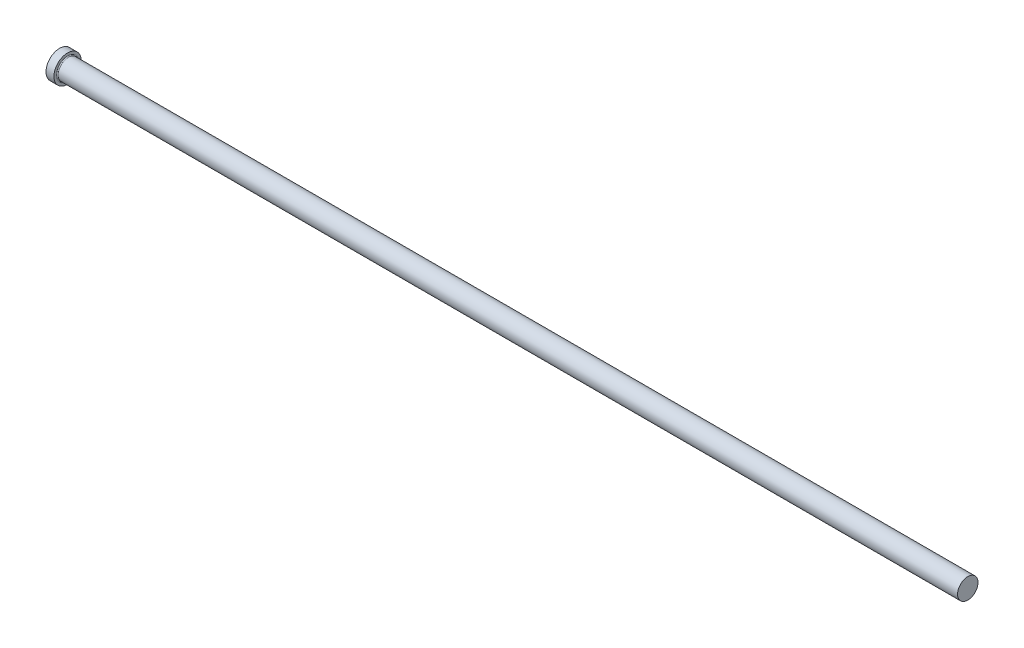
ISO-10303-21;
HEADER;
FILE_DESCRIPTION(('STEP AP214'),'2;1');
FILE_NAME('part.step','',(''),(''),'','','');
FILE_SCHEMA(('AUTOMOTIVE_DESIGN { 1 0 10303 214 1 1 1 1 }'));
ENDSEC;
DATA;
#1=APPLICATION_CONTEXT('core data for automotive mechanical design processes');
#2=APPLICATION_PROTOCOL_DEFINITION('international standard','automotive_design',2000,#1);
#3=PRODUCT_CONTEXT('',#1,'mechanical');
#4=PRODUCT('Part','Part','',(#3));
#5=PRODUCT_RELATED_PRODUCT_CATEGORY('part','',(#4));
#6=PRODUCT_DEFINITION_FORMATION('','',#4);
#7=PRODUCT_DEFINITION_CONTEXT('part definition',#1,'design');
#8=PRODUCT_DEFINITION('design','',#6,#7);
#9=PRODUCT_DEFINITION_SHAPE('','',#8);
#10=(LENGTH_UNIT() NAMED_UNIT(*) SI_UNIT(.MILLI.,.METRE.));
#11=(NAMED_UNIT(*) PLANE_ANGLE_UNIT() SI_UNIT($,.RADIAN.));
#12=(NAMED_UNIT(*) SI_UNIT($,.STERADIAN.) SOLID_ANGLE_UNIT());
#13=UNCERTAINTY_MEASURE_WITH_UNIT(LENGTH_MEASURE(1.E-05),#10,'distance_accuracy_value','');
#14=(GEOMETRIC_REPRESENTATION_CONTEXT(3) GLOBAL_UNCERTAINTY_ASSIGNED_CONTEXT((#13)) GLOBAL_UNIT_ASSIGNED_CONTEXT((#10,
#11,#12)) REPRESENTATION_CONTEXT('',''));
#15=CARTESIAN_POINT('',(0.,0.,0.));
#16=DIRECTION('',(0.,0.,1.));
#17=DIRECTION('',(1.,0.,0.));
#18=AXIS2_PLACEMENT_3D('',#15,#16,#17);
#19=CARTESIAN_POINT('',(0.,0.,0.));
#20=DIRECTION('',(-1.,0.,0.));
#21=DIRECTION('',(0.,-1.,0.));
#22=AXIS2_PLACEMENT_3D('',#19,#20,#21);
#23=PLANE('',#22);
#24=CARTESIAN_POINT('',(0.,0.,0.));
#25=DIRECTION('',(1.,0.,0.));
#26=DIRECTION('',(0.,1.,0.));
#27=AXIS2_PLACEMENT_3D('',#24,#25,#26);
#28=CIRCLE('',#27,12.);
#29=CARTESIAN_POINT('',(0.,12.,0.));
#30=VERTEX_POINT('',#29);
#31=EDGE_CURVE('E25',#30,#30,#28,.T.);
#32=ORIENTED_EDGE('',*,*,#31,.F.);
#33=EDGE_LOOP('',(#32));
#34=FACE_BOUND('',#33,.T.);
#35=ADVANCED_FACE('F14',(#34),#23,.T.);
#36=CARTESIAN_POINT('',(800.,0.,0.));
#37=DIRECTION('',(1.,0.,0.));
#38=DIRECTION('',(0.,1.,0.));
#39=AXIS2_PLACEMENT_3D('',#36,#37,#38);
#40=CYLINDRICAL_SURFACE('',#39,12.);
#41=ORIENTED_EDGE('',*,*,#31,.T.);
#42=EDGE_LOOP('',(#41));
#43=FACE_BOUND('',#42,.T.);
#44=CARTESIAN_POINT('',(7.,0.,0.));
#45=DIRECTION('',(1.,0.,0.));
#46=DIRECTION('',(0.,1.,0.));
#47=AXIS2_PLACEMENT_3D('',#44,#45,#46);
#48=CIRCLE('',#47,12.);
#49=CARTESIAN_POINT('',(7.,12.,0.));
#50=VERTEX_POINT('',#49);
#51=EDGE_CURVE('E29',#50,#50,#48,.T.);
#52=ORIENTED_EDGE('',*,*,#51,.F.);
#53=EDGE_LOOP('',(#52));
#54=FACE_BOUND('',#53,.T.);
#55=ADVANCED_FACE('F51',(#43,#54),#40,.T.);
#56=CARTESIAN_POINT('',(7.,12.,0.));
#57=DIRECTION('',(1.,0.,0.));
#58=DIRECTION('',(0.,1.,0.));
#59=AXIS2_PLACEMENT_3D('',#56,#57,#58);
#60=PLANE('',#59);
#61=CARTESIAN_POINT('',(7.,0.,0.));
#62=DIRECTION('',(1.,0.,0.));
#63=DIRECTION('',(0.,1.,0.));
#64=AXIS2_PLACEMENT_3D('',#61,#62,#63);
#65=CIRCLE('',#64,9.8);
#66=CARTESIAN_POINT('',(7.,9.8,0.));
#67=VERTEX_POINT('',#66);
#68=EDGE_CURVE('E9',#67,#67,#65,.F.);
#69=ORIENTED_EDGE('',*,*,#68,.T.);
#70=EDGE_LOOP('',(#69));
#71=FACE_BOUND('',#70,.T.);
#72=ORIENTED_EDGE('',*,*,#51,.T.);
#73=EDGE_LOOP('',(#72));
#74=FACE_BOUND('',#73,.T.);
#75=ADVANCED_FACE('F42',(#71,#74),#60,.T.);
#76=CARTESIAN_POINT('',(800.,0.,0.));
#77=DIRECTION('',(1.,0.,0.));
#78=DIRECTION('',(0.,1.,0.));
#79=AXIS2_PLACEMENT_3D('',#76,#77,#78);
#80=CYLINDRICAL_SURFACE('',#79,9.);
#81=CARTESIAN_POINT('',(7.8,0.,0.));
#82=DIRECTION('',(1.,0.,0.));
#83=DIRECTION('',(0.,1.,0.));
#84=AXIS2_PLACEMENT_3D('',#81,#82,#83);
#85=CIRCLE('',#84,9.);
#86=CARTESIAN_POINT('',(7.8,9.,0.));
#87=VERTEX_POINT('',#86);
#88=EDGE_CURVE('E21',#87,#87,#85,.T.);
#89=ORIENTED_EDGE('',*,*,#88,.T.);
#90=EDGE_LOOP('',(#89));
#91=FACE_BOUND('',#90,.T.);
#92=CARTESIAN_POINT('',(800.,0.,0.));
#93=DIRECTION('',(1.,0.,0.));
#94=DIRECTION('',(0.,1.,0.));
#95=AXIS2_PLACEMENT_3D('',#92,#93,#94);
#96=CIRCLE('',#95,8.9999999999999);
#97=CARTESIAN_POINT('',(800.,8.99999999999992,0.));
#98=VERTEX_POINT('',#97);
#99=EDGE_CURVE('E34',#98,#98,#96,.T.);
#100=ORIENTED_EDGE('',*,*,#99,.F.);
#101=EDGE_LOOP('',(#100));
#102=FACE_BOUND('',#101,.T.);
#103=ADVANCED_FACE('F40',(#91,#102),#80,.T.);
#104=CARTESIAN_POINT('',(800.,9.,0.));
#105=DIRECTION('',(1.,0.,0.));
#106=DIRECTION('',(0.,1.,0.));
#107=AXIS2_PLACEMENT_3D('',#104,#105,#106);
#108=PLANE('',#107);
#109=ORIENTED_EDGE('',*,*,#99,.T.);
#110=EDGE_LOOP('',(#109));
#111=FACE_BOUND('',#110,.T.);
#112=ADVANCED_FACE('F38',(#111),#108,.T.);
#113=CARTESIAN_POINT('',(7.8,0.,0.));
#114=DIRECTION('',(1.,0.,0.));
#115=DIRECTION('',(0.,1.,0.));
#116=AXIS2_PLACEMENT_3D('',#113,#114,#115);
#117=TOROIDAL_SURFACE('',#116,9.8,0.8);
#118=ORIENTED_EDGE('',*,*,#68,.F.);
#119=EDGE_LOOP('',(#118));
#120=FACE_BOUND('',#119,.T.);
#121=ORIENTED_EDGE('',*,*,#88,.F.);
#122=EDGE_LOOP('',(#121));
#123=FACE_BOUND('',#122,.T.);
#124=ADVANCED_FACE('F16',(#120,#123),#117,.F.);
#125=CLOSED_SHELL('',(#35,#55,#75,#103,#112,#124));
#126=MANIFOLD_SOLID_BREP('B1',#125);
#127=ADVANCED_BREP_SHAPE_REPRESENTATION('',(#18,#126),#14);
#128=SHAPE_DEFINITION_REPRESENTATION(#9,#127);
ENDSEC;
END-ISO-10303-21;
